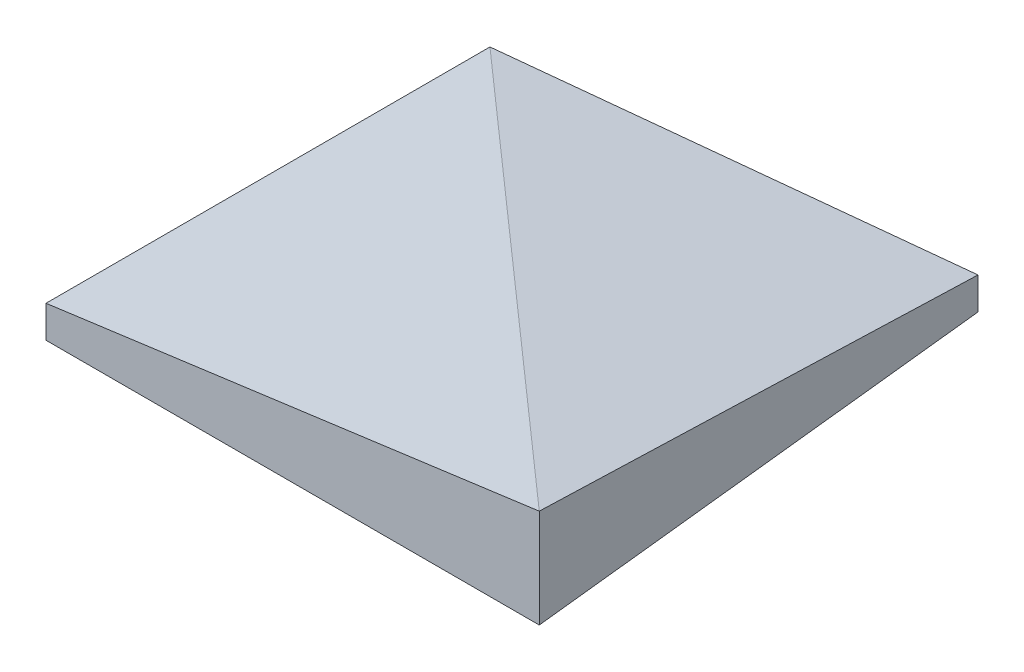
ISO-10303-21;
HEADER;
FILE_DESCRIPTION(('STEP AP214'),'2;1');
FILE_NAME('part.step','',(''),(''),'','','');
FILE_SCHEMA(('AUTOMOTIVE_DESIGN { 1 0 10303 214 1 1 1 1 }'));
ENDSEC;
DATA;
#1=APPLICATION_CONTEXT('core data for automotive mechanical design processes');
#2=APPLICATION_PROTOCOL_DEFINITION('international standard','automotive_design',2000,#1);
#3=PRODUCT_CONTEXT('',#1,'mechanical');
#4=PRODUCT('Part','Part','',(#3));
#5=PRODUCT_RELATED_PRODUCT_CATEGORY('part','',(#4));
#6=PRODUCT_DEFINITION_FORMATION('','',#4);
#7=PRODUCT_DEFINITION_CONTEXT('part definition',#1,'design');
#8=PRODUCT_DEFINITION('design','',#6,#7);
#9=PRODUCT_DEFINITION_SHAPE('','',#8);
#10=(LENGTH_UNIT() NAMED_UNIT(*) SI_UNIT(.MILLI.,.METRE.));
#11=(NAMED_UNIT(*) PLANE_ANGLE_UNIT() SI_UNIT($,.RADIAN.));
#12=(NAMED_UNIT(*) SI_UNIT($,.STERADIAN.) SOLID_ANGLE_UNIT());
#13=UNCERTAINTY_MEASURE_WITH_UNIT(LENGTH_MEASURE(1.E-05),#10,'distance_accuracy_value','');
#14=(GEOMETRIC_REPRESENTATION_CONTEXT(3) GLOBAL_UNCERTAINTY_ASSIGNED_CONTEXT((#13)) GLOBAL_UNIT_ASSIGNED_CONTEXT((#10,
#11,#12)) REPRESENTATION_CONTEXT('',''));
#15=CARTESIAN_POINT('',(0.,0.,0.));
#16=DIRECTION('',(0.,0.,1.));
#17=DIRECTION('',(1.,0.,0.));
#18=AXIS2_PLACEMENT_3D('',#15,#16,#17);
#19=CARTESIAN_POINT('',(-1000.,400.,1.2335811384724E-13));
#20=DIRECTION('',(1.,0.,0.));
#21=DIRECTION('',(0.,0.,-1.));
#22=AXIS2_PLACEMENT_3D('',#19,#20,#21);
#23=PLANE('',#22);
#24=DIRECTION('',(0.,-1.,0.));
#25=VECTOR('',#24,1.);
#26=CARTESIAN_POINT('',(-1000.,400.,900.));
#27=LINE('',#26,#25);
#28=CARTESIAN_POINT('',(-1000.,130.,900.));
#29=VERTEX_POINT('',#28);
#30=CARTESIAN_POINT('',(-1000.,0.,900.));
#31=VERTEX_POINT('',#30);
#32=EDGE_CURVE('E11',#29,#31,#27,.T.);
#33=ORIENTED_EDGE('',*,*,#32,.F.);
#34=DIRECTION('',(0.,0.,-1.));
#35=VECTOR('',#34,1.);
#36=CARTESIAN_POINT('',(-1000.,130.,4300.36762718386));
#37=LINE('',#36,#35);
#38=CARTESIAN_POINT('',(-999.999999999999,130.,-899.999999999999));
#39=VERTEX_POINT('',#38);
#40=EDGE_CURVE('E96',#29,#39,#37,.T.);
#41=ORIENTED_EDGE('',*,*,#40,.T.);
#42=DIRECTION('',(0.,-1.,0.));
#43=VECTOR('',#42,1.);
#44=CARTESIAN_POINT('',(-1000.,400.,-900.));
#45=LINE('',#44,#43);
#46=CARTESIAN_POINT('',(-1000.,0.,-900.));
#47=VERTEX_POINT('',#46);
#48=EDGE_CURVE('E86',#39,#47,#45,.T.);
#49=ORIENTED_EDGE('',*,*,#48,.T.);
#50=DIRECTION('',(0.,0.,1.));
#51=VECTOR('',#50,1.);
#52=CARTESIAN_POINT('',(-1000.,0.,1.2335811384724E-13));
#53=LINE('',#52,#51);
#54=EDGE_CURVE('E110',#47,#31,#53,.T.);
#55=ORIENTED_EDGE('',*,*,#54,.T.);
#56=EDGE_LOOP('',(#33,#41,#49,#55));
#57=FACE_BOUND('',#56,.T.);
#58=ADVANCED_FACE('F37',(#57),#23,.F.);
#59=CARTESIAN_POINT('',(0.,400.,900.));
#60=DIRECTION('',(0.,0.,-1.));
#61=DIRECTION('',(-1.,0.,0.));
#62=AXIS2_PLACEMENT_3D('',#59,#60,#61);
#63=PLANE('',#62);
#64=DIRECTION('',(0.,-1.,0.));
#65=VECTOR('',#64,1.);
#66=CARTESIAN_POINT('',(1000.,400.,900.));
#67=LINE('',#66,#65);
#68=CARTESIAN_POINT('',(1000.,400.,900.));
#69=VERTEX_POINT('',#68);
#70=CARTESIAN_POINT('',(1000.,0.,900.));
#71=VERTEX_POINT('',#70);
#72=EDGE_CURVE('E92',#69,#71,#67,.T.);
#73=ORIENTED_EDGE('',*,*,#72,.F.);
#74=DIRECTION('',(-0.991010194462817,-0.13378637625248,0.));
#75=VECTOR('',#74,1.);
#76=CARTESIAN_POINT('',(17.8987944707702,267.416337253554,900.));
#77=LINE('',#76,#75);
#78=EDGE_CURVE('E50',#69,#29,#77,.T.);
#79=ORIENTED_EDGE('',*,*,#78,.T.);
#80=ORIENTED_EDGE('',*,*,#32,.T.);
#81=DIRECTION('',(1.,0.,0.));
#82=VECTOR('',#81,1.);
#83=CARTESIAN_POINT('',(0.,0.,900.));
#84=LINE('',#83,#82);
#85=EDGE_CURVE('E44',#31,#71,#84,.T.);
#86=ORIENTED_EDGE('',*,*,#85,.T.);
#87=EDGE_LOOP('',(#73,#79,#80,#86));
#88=FACE_BOUND('',#87,.T.);
#89=ADVANCED_FACE('F113',(#88),#63,.F.);
#90=CARTESIAN_POINT('',(0.,0.,0.));
#91=DIRECTION('',(0.,1.,0.));
#92=DIRECTION('',(0.,0.,1.));
#93=AXIS2_PLACEMENT_3D('',#90,#91,#92);
#94=PLANE('',#93);
#95=ORIENTED_EDGE('',*,*,#54,.F.);
#96=DIRECTION('',(0.994475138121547,0.,-0.104972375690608));
#97=VECTOR('',#96,1.);
#98=CARTESIAN_POINT('',(-104.972375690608,0.,-994.475138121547));
#99=LINE('',#98,#97);
#100=CARTESIAN_POINT('',(790.055248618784,0.,-1088.95027624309));
#101=VERTEX_POINT('',#100);
#102=EDGE_CURVE('E58',#47,#101,#99,.T.);
#103=ORIENTED_EDGE('',*,*,#102,.T.);
#104=DIRECTION('',(0.104972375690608,0.,0.994475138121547));
#105=VECTOR('',#104,1.);
#106=CARTESIAN_POINT('',(895.027624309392,0.,-94.4751381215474));
#107=LINE('',#106,#105);
#108=EDGE_CURVE('E93',#101,#71,#107,.T.);
#109=ORIENTED_EDGE('',*,*,#108,.T.);
#110=ORIENTED_EDGE('',*,*,#85,.F.);
#111=EDGE_LOOP('',(#95,#103,#109,#110));
#112=FACE_BOUND('',#111,.T.);
#113=ADVANCED_FACE('F115',(#112),#94,.F.);
#114=CARTESIAN_POINT('',(1000.,400.,4300.36762718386));
#115=DIRECTION('',(0.13378637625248,-0.991010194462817,0.));
#116=DIRECTION('',(0.991010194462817,0.13378637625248,0.));
#117=AXIS2_PLACEMENT_3D('',#114,#115,#116);
#118=PLANE('',#117);
#119=ORIENTED_EDGE('',*,*,#78,.F.);
#120=DIRECTION('',(-0.739580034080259,-0.099843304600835,-0.665622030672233));
#121=VECTOR('',#120,1.);
#122=CARTESIAN_POINT('',(9.96868547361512,266.345772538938,8.97181692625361));
#123=LINE('',#122,#121);
#124=EDGE_CURVE('E81',#69,#39,#123,.T.);
#125=ORIENTED_EDGE('',*,*,#124,.T.);
#126=ORIENTED_EDGE('',*,*,#40,.F.);
#127=EDGE_LOOP('',(#119,#125,#126));
#128=FACE_BOUND('',#127,.T.);
#129=ADVANCED_FACE('F100',(#128),#118,.F.);
#130=CARTESIAN_POINT('',(-104.972375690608,400.,-994.475138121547));
#131=DIRECTION('',(0.104972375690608,0.,0.994475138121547));
#132=DIRECTION('',(-0.994475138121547,0.,0.104972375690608));
#133=AXIS2_PLACEMENT_3D('',#130,#131,#132);
#134=PLANE('',#133);
#135=DIRECTION('',(0.,-1.,0.));
#136=VECTOR('',#135,1.);
#137=CARTESIAN_POINT('',(790.055248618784,400.,-1088.95027624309));
#138=LINE('',#137,#136);
#139=CARTESIAN_POINT('',(790.055248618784,130.,-1088.95027624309));
#140=VERTEX_POINT('',#139);
#141=EDGE_CURVE('E98',#140,#101,#138,.T.);
#142=ORIENTED_EDGE('',*,*,#141,.T.);
#143=ORIENTED_EDGE('',*,*,#102,.F.);
#144=ORIENTED_EDGE('',*,*,#48,.F.);
#145=DIRECTION('',(-0.994475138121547,0.,0.104972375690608));
#146=VECTOR('',#145,1.);
#147=CARTESIAN_POINT('',(4171.63631432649,130.,-1445.89494429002));
#148=LINE('',#147,#146);
#149=EDGE_CURVE('E78',#140,#39,#148,.T.);
#150=ORIENTED_EDGE('',*,*,#149,.F.);
#151=EDGE_LOOP('',(#142,#143,#144,#150));
#152=FACE_BOUND('',#151,.T.);
#153=ADVANCED_FACE('F88',(#152),#134,.F.);
#154=CARTESIAN_POINT('',(895.027624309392,400.,-94.4751381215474));
#155=DIRECTION('',(-0.994475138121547,0.,0.104972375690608));
#156=DIRECTION('',(-0.104972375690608,0.,-0.994475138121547));
#157=AXIS2_PLACEMENT_3D('',#154,#155,#156);
#158=PLANE('',#157);
#159=ORIENTED_EDGE('',*,*,#72,.T.);
#160=ORIENTED_EDGE('',*,*,#108,.F.);
#161=ORIENTED_EDGE('',*,*,#141,.F.);
#162=DIRECTION('',(-0.104028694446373,-0.13378637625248,-0.985535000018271));
#163=VECTOR('',#162,1.);
#164=CARTESIAN_POINT('',(896.906503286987,267.416337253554,-76.675232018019));
#165=LINE('',#164,#163);
#166=EDGE_CURVE('E83',#69,#140,#165,.T.);
#167=ORIENTED_EDGE('',*,*,#166,.F.);
#168=EDGE_LOOP('',(#159,#160,#161,#167));
#169=FACE_BOUND('',#168,.T.);
#170=ADVANCED_FACE('F117',(#169),#158,.F.);
#171=CARTESIAN_POINT('',(4381.58106570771,400.,543.055331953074));
#172=DIRECTION('',(0.0140438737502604,-0.991010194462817,0.133047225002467));
#173=DIRECTION('',(0.104028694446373,0.13378637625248,0.985535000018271));
#174=AXIS2_PLACEMENT_3D('',#171,#172,#173);
#175=PLANE('',#174);
#176=ORIENTED_EDGE('',*,*,#166,.T.);
#177=ORIENTED_EDGE('',*,*,#149,.T.);
#178=ORIENTED_EDGE('',*,*,#124,.F.);
#179=EDGE_LOOP('',(#176,#177,#178));
#180=FACE_BOUND('',#179,.T.);
#181=ADVANCED_FACE('F79',(#180),#175,.F.);
#182=CLOSED_SHELL('',(#58,#89,#113,#129,#153,#170,#181));
#183=MANIFOLD_SOLID_BREP('B2',#182);
#184=ADVANCED_BREP_SHAPE_REPRESENTATION('',(#18,#183),#14);
#185=SHAPE_DEFINITION_REPRESENTATION(#9,#184);
ENDSEC;
END-ISO-10303-21;
